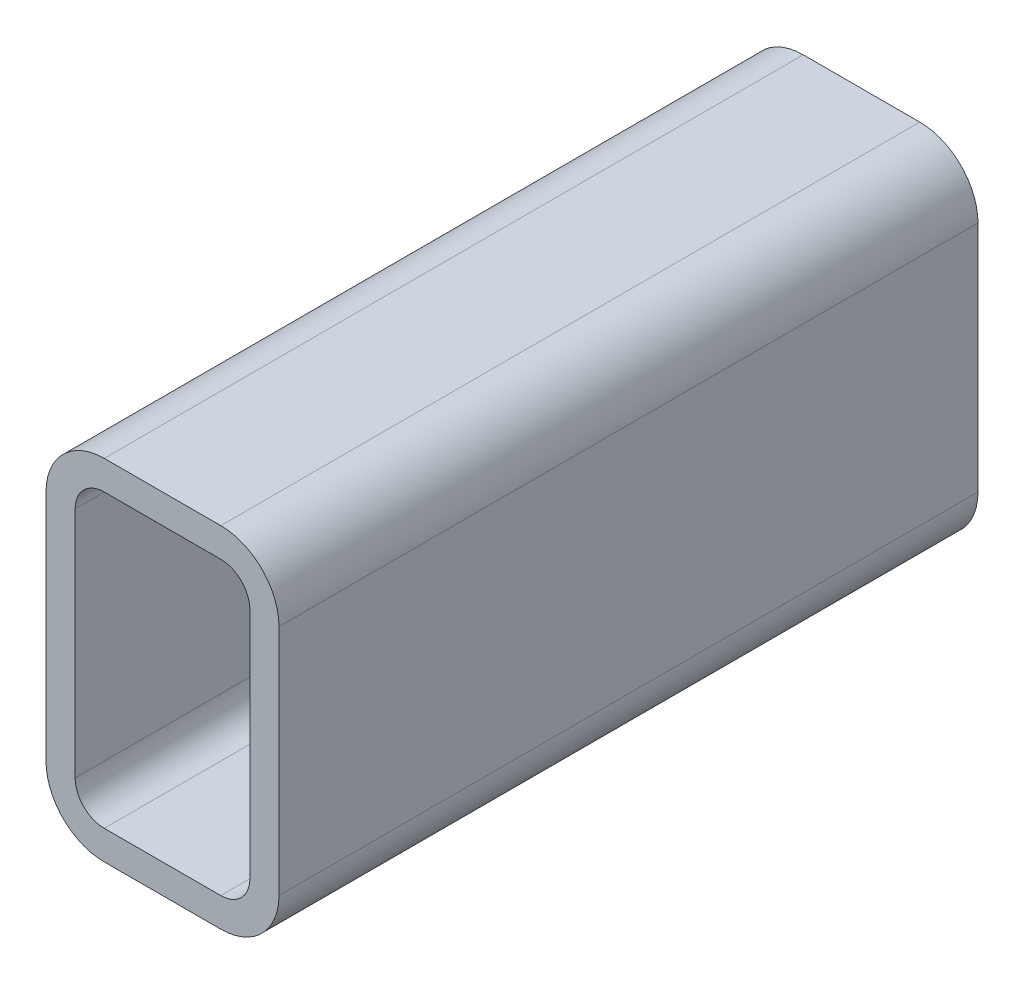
ISO-10303-21;
HEADER;
FILE_DESCRIPTION(('STEP AP214'),'2;1');
FILE_NAME('part.step','',(''),(''),'','','');
FILE_SCHEMA(('AUTOMOTIVE_DESIGN { 1 0 10303 214 1 1 1 1 }'));
ENDSEC;
DATA;
#1=APPLICATION_CONTEXT('core data for automotive mechanical design processes');
#2=APPLICATION_PROTOCOL_DEFINITION('international standard','automotive_design',2000,#1);
#3=PRODUCT_CONTEXT('',#1,'mechanical');
#4=PRODUCT('Part','Part','',(#3));
#5=PRODUCT_RELATED_PRODUCT_CATEGORY('part','',(#4));
#6=PRODUCT_DEFINITION_FORMATION('','',#4);
#7=PRODUCT_DEFINITION_CONTEXT('part definition',#1,'design');
#8=PRODUCT_DEFINITION('design','',#6,#7);
#9=PRODUCT_DEFINITION_SHAPE('','',#8);
#10=(LENGTH_UNIT() NAMED_UNIT(*) SI_UNIT(.MILLI.,.METRE.));
#11=(NAMED_UNIT(*) PLANE_ANGLE_UNIT() SI_UNIT($,.RADIAN.));
#12=(NAMED_UNIT(*) SI_UNIT($,.STERADIAN.) SOLID_ANGLE_UNIT());
#13=UNCERTAINTY_MEASURE_WITH_UNIT(LENGTH_MEASURE(1.E-05),#10,'distance_accuracy_value','');
#14=(GEOMETRIC_REPRESENTATION_CONTEXT(3) GLOBAL_UNCERTAINTY_ASSIGNED_CONTEXT((#13)) GLOBAL_UNIT_ASSIGNED_CONTEXT((#10,
#11,#12)) REPRESENTATION_CONTEXT('',''));
#15=CARTESIAN_POINT('',(0.,0.,0.));
#16=DIRECTION('',(0.,0.,1.));
#17=DIRECTION('',(1.,0.,0.));
#18=AXIS2_PLACEMENT_3D('',#15,#16,#17);
#19=CARTESIAN_POINT('',(27.0751778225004,129.011948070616,304.8));
#20=DIRECTION('',(0.,0.,1.));
#21=DIRECTION('',(1.,0.,0.));
#22=AXIS2_PLACEMENT_3D('',#19,#20,#21);
#23=PLANE('',#22);
#24=CARTESIAN_POINT('',(27.0751778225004,129.011948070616,304.8));
#25=DIRECTION('',(0.,0.,1.));
#26=DIRECTION('',(1.,0.,0.));
#27=AXIS2_PLACEMENT_3D('',#24,#25,#26);
#28=CIRCLE('',#27,25.4);
#29=CARTESIAN_POINT('',(27.0751778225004,154.411948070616,304.8));
#30=VERTEX_POINT('',#29);
#31=CARTESIAN_POINT('',(1.67517782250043,129.011948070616,304.8));
#32=VERTEX_POINT('',#31);
#33=EDGE_CURVE('E211',#30,#32,#28,.T.);
#34=ORIENTED_EDGE('',*,*,#33,.T.);
#35=DIRECTION('',(0.,-1.,0.));
#36=VECTOR('',#35,1.);
#37=CARTESIAN_POINT('',(1.67517782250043,27.4119480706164,304.8));
#38=LINE('',#37,#36);
#39=CARTESIAN_POINT('',(1.67517782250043,27.4119480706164,304.8));
#40=VERTEX_POINT('',#39);
#41=EDGE_CURVE('E214',#32,#40,#38,.T.);
#42=ORIENTED_EDGE('',*,*,#41,.T.);
#43=CARTESIAN_POINT('',(27.0751778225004,27.4119480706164,304.8));
#44=DIRECTION('',(0.,0.,1.));
#45=DIRECTION('',(1.,0.,0.));
#46=AXIS2_PLACEMENT_3D('',#43,#44,#45);
#47=CIRCLE('',#46,25.4);
#48=CARTESIAN_POINT('',(27.0751778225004,2.01194807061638,304.8));
#49=VERTEX_POINT('',#48);
#50=EDGE_CURVE('E217',#40,#49,#47,.T.);
#51=ORIENTED_EDGE('',*,*,#50,.T.);
#52=DIRECTION('',(1.,0.,0.));
#53=VECTOR('',#52,1.);
#54=CARTESIAN_POINT('',(77.8751778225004,2.01194807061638,304.8));
#55=LINE('',#54,#53);
#56=CARTESIAN_POINT('',(77.8751778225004,2.01194807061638,304.8));
#57=VERTEX_POINT('',#56);
#58=EDGE_CURVE('E219',#49,#57,#55,.T.);
#59=ORIENTED_EDGE('',*,*,#58,.T.);
#60=CARTESIAN_POINT('',(77.8751778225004,27.4119480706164,304.8));
#61=DIRECTION('',(0.,0.,1.));
#62=DIRECTION('',(1.,0.,0.));
#63=AXIS2_PLACEMENT_3D('',#60,#61,#62);
#64=CIRCLE('',#63,25.4);
#65=CARTESIAN_POINT('',(103.2751778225,27.4119480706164,304.8));
#66=VERTEX_POINT('',#65);
#67=EDGE_CURVE('E221',#57,#66,#64,.T.);
#68=ORIENTED_EDGE('',*,*,#67,.T.);
#69=DIRECTION('',(0.,1.,0.));
#70=VECTOR('',#69,1.);
#71=CARTESIAN_POINT('',(103.2751778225,129.011948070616,304.8));
#72=LINE('',#71,#70);
#73=CARTESIAN_POINT('',(103.2751778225,129.011948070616,304.8));
#74=VERTEX_POINT('',#73);
#75=EDGE_CURVE('E223',#66,#74,#72,.T.);
#76=ORIENTED_EDGE('',*,*,#75,.T.);
#77=CARTESIAN_POINT('',(77.8751778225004,129.011948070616,304.8));
#78=DIRECTION('',(0.,0.,1.));
#79=DIRECTION('',(1.,0.,0.));
#80=AXIS2_PLACEMENT_3D('',#77,#78,#79);
#81=CIRCLE('',#80,25.4);
#82=CARTESIAN_POINT('',(77.8751778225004,154.411948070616,304.8));
#83=VERTEX_POINT('',#82);
#84=EDGE_CURVE('E225',#74,#83,#81,.T.);
#85=ORIENTED_EDGE('',*,*,#84,.T.);
#86=DIRECTION('',(-1.,0.,0.));
#87=VECTOR('',#86,1.);
#88=CARTESIAN_POINT('',(27.0751778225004,154.411948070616,304.8));
#89=LINE('',#88,#87);
#90=EDGE_CURVE('E227',#83,#30,#89,.T.);
#91=ORIENTED_EDGE('',*,*,#90,.T.);
#92=EDGE_LOOP('',(#34,#42,#51,#59,#68,#76,#85,#91));
#93=FACE_BOUND('',#92,.T.);
#94=DIRECTION('',(0.,-1.,0.));
#95=VECTOR('',#94,1.);
#96=CARTESIAN_POINT('',(14.3751778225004,27.4119480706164,304.8));
#97=LINE('',#96,#95);
#98=CARTESIAN_POINT('',(14.3751778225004,129.011948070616,304.8));
#99=VERTEX_POINT('',#98);
#100=CARTESIAN_POINT('',(14.3751778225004,27.4119480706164,304.8));
#101=VERTEX_POINT('',#100);
#102=EDGE_CURVE('E154',#99,#101,#97,.T.);
#103=ORIENTED_EDGE('',*,*,#102,.F.);
#104=CARTESIAN_POINT('',(27.0751778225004,129.011948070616,304.8));
#105=DIRECTION('',(0.,0.,1.));
#106=DIRECTION('',(1.,0.,0.));
#107=AXIS2_PLACEMENT_3D('',#104,#105,#106);
#108=CIRCLE('',#107,12.7);
#109=CARTESIAN_POINT('',(27.0751778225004,141.711948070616,304.8));
#110=VERTEX_POINT('',#109);
#111=EDGE_CURVE('E146',#110,#99,#108,.T.);
#112=ORIENTED_EDGE('',*,*,#111,.F.);
#113=DIRECTION('',(-1.,0.,0.));
#114=VECTOR('',#113,1.);
#115=CARTESIAN_POINT('',(27.0751778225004,141.711948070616,304.8));
#116=LINE('',#115,#114);
#117=CARTESIAN_POINT('',(77.8751778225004,141.711948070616,304.8));
#118=VERTEX_POINT('',#117);
#119=EDGE_CURVE('E179',#118,#110,#116,.T.);
#120=ORIENTED_EDGE('',*,*,#119,.F.);
#121=CARTESIAN_POINT('',(77.8751778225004,129.011948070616,304.8));
#122=DIRECTION('',(0.,0.,1.));
#123=DIRECTION('',(1.,0.,0.));
#124=AXIS2_PLACEMENT_3D('',#121,#122,#123);
#125=CIRCLE('',#124,12.7);
#126=CARTESIAN_POINT('',(90.5751778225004,129.011948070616,304.8));
#127=VERTEX_POINT('',#126);
#128=EDGE_CURVE('E177',#127,#118,#125,.T.);
#129=ORIENTED_EDGE('',*,*,#128,.F.);
#130=DIRECTION('',(0.,1.,0.));
#131=VECTOR('',#130,1.);
#132=CARTESIAN_POINT('',(90.5751778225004,129.011948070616,304.8));
#133=LINE('',#132,#131);
#134=CARTESIAN_POINT('',(90.5751778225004,27.4119480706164,304.8));
#135=VERTEX_POINT('',#134);
#136=EDGE_CURVE('E175',#135,#127,#133,.T.);
#137=ORIENTED_EDGE('',*,*,#136,.F.);
#138=CARTESIAN_POINT('',(77.8751778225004,27.4119480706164,304.8));
#139=DIRECTION('',(0.,0.,1.));
#140=DIRECTION('',(1.,0.,0.));
#141=AXIS2_PLACEMENT_3D('',#138,#139,#140);
#142=CIRCLE('',#141,12.7);
#143=CARTESIAN_POINT('',(77.8751778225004,14.7119480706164,304.8));
#144=VERTEX_POINT('',#143);
#145=EDGE_CURVE('E173',#144,#135,#142,.T.);
#146=ORIENTED_EDGE('',*,*,#145,.F.);
#147=DIRECTION('',(1.,0.,0.));
#148=VECTOR('',#147,1.);
#149=CARTESIAN_POINT('',(77.8751778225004,14.7119480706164,304.8));
#150=LINE('',#149,#148);
#151=CARTESIAN_POINT('',(27.0751778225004,14.7119480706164,304.8));
#152=VERTEX_POINT('',#151);
#153=EDGE_CURVE('E169',#152,#144,#150,.T.);
#154=ORIENTED_EDGE('',*,*,#153,.F.);
#155=CARTESIAN_POINT('',(27.0751778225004,27.4119480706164,304.8));
#156=DIRECTION('',(0.,0.,1.));
#157=DIRECTION('',(1.,0.,0.));
#158=AXIS2_PLACEMENT_3D('',#155,#156,#157);
#159=CIRCLE('',#158,12.7);
#160=EDGE_CURVE('E167',#101,#152,#159,.T.);
#161=ORIENTED_EDGE('',*,*,#160,.F.);
#162=EDGE_LOOP('',(#103,#112,#120,#129,#137,#146,#154,#161));
#163=FACE_BOUND('',#162,.T.);
#164=ADVANCED_FACE('F33',(#93,#163),#23,.T.);
#165=CARTESIAN_POINT('',(27.0751778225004,129.011948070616,0.));
#166=DIRECTION('',(0.,0.,1.));
#167=DIRECTION('',(1.,0.,0.));
#168=AXIS2_PLACEMENT_3D('',#165,#166,#167);
#169=PLANE('',#168);
#170=CARTESIAN_POINT('',(27.0751778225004,129.011948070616,0.));
#171=DIRECTION('',(0.,0.,1.));
#172=DIRECTION('',(1.,0.,0.));
#173=AXIS2_PLACEMENT_3D('',#170,#171,#172);
#174=CIRCLE('',#173,25.4);
#175=CARTESIAN_POINT('',(27.0751778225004,154.411948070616,0.));
#176=VERTEX_POINT('',#175);
#177=CARTESIAN_POINT('',(1.67517782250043,129.011948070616,0.));
#178=VERTEX_POINT('',#177);
#179=EDGE_CURVE('E162',#176,#178,#174,.T.);
#180=ORIENTED_EDGE('',*,*,#179,.F.);
#181=DIRECTION('',(-1.,0.,0.));
#182=VECTOR('',#181,1.);
#183=CARTESIAN_POINT('',(27.0751778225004,154.411948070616,0.));
#184=LINE('',#183,#182);
#185=CARTESIAN_POINT('',(77.8751778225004,154.411948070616,0.));
#186=VERTEX_POINT('',#185);
#187=EDGE_CURVE('E215',#186,#176,#184,.T.);
#188=ORIENTED_EDGE('',*,*,#187,.F.);
#189=CARTESIAN_POINT('',(77.8751778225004,129.011948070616,0.));
#190=DIRECTION('',(0.,0.,1.));
#191=DIRECTION('',(1.,0.,0.));
#192=AXIS2_PLACEMENT_3D('',#189,#190,#191);
#193=CIRCLE('',#192,25.4);
#194=CARTESIAN_POINT('',(103.2751778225,129.011948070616,0.));
#195=VERTEX_POINT('',#194);
#196=EDGE_CURVE('E242',#195,#186,#193,.T.);
#197=ORIENTED_EDGE('',*,*,#196,.F.);
#198=DIRECTION('',(0.,1.,0.));
#199=VECTOR('',#198,1.);
#200=CARTESIAN_POINT('',(103.2751778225,129.011948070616,0.));
#201=LINE('',#200,#199);
#202=CARTESIAN_POINT('',(103.2751778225,27.4119480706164,0.));
#203=VERTEX_POINT('',#202);
#204=EDGE_CURVE('E240',#203,#195,#201,.T.);
#205=ORIENTED_EDGE('',*,*,#204,.F.);
#206=CARTESIAN_POINT('',(77.8751778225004,27.4119480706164,0.));
#207=DIRECTION('',(0.,0.,1.));
#208=DIRECTION('',(1.,0.,0.));
#209=AXIS2_PLACEMENT_3D('',#206,#207,#208);
#210=CIRCLE('',#209,25.4);
#211=CARTESIAN_POINT('',(77.8751778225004,2.01194807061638,0.));
#212=VERTEX_POINT('',#211);
#213=EDGE_CURVE('E238',#212,#203,#210,.T.);
#214=ORIENTED_EDGE('',*,*,#213,.F.);
#215=DIRECTION('',(1.,0.,0.));
#216=VECTOR('',#215,1.);
#217=CARTESIAN_POINT('',(77.8751778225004,2.01194807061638,0.));
#218=LINE('',#217,#216);
#219=CARTESIAN_POINT('',(27.0751778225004,2.01194807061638,0.));
#220=VERTEX_POINT('',#219);
#221=EDGE_CURVE('E236',#220,#212,#218,.T.);
#222=ORIENTED_EDGE('',*,*,#221,.F.);
#223=CARTESIAN_POINT('',(27.0751778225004,27.4119480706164,0.));
#224=DIRECTION('',(0.,0.,1.));
#225=DIRECTION('',(1.,0.,0.));
#226=AXIS2_PLACEMENT_3D('',#223,#224,#225);
#227=CIRCLE('',#226,25.4);
#228=CARTESIAN_POINT('',(1.67517782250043,27.4119480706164,0.));
#229=VERTEX_POINT('',#228);
#230=EDGE_CURVE('E234',#229,#220,#227,.T.);
#231=ORIENTED_EDGE('',*,*,#230,.F.);
#232=DIRECTION('',(0.,-1.,0.));
#233=VECTOR('',#232,1.);
#234=CARTESIAN_POINT('',(1.67517782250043,27.4119480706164,0.));
#235=LINE('',#234,#233);
#236=EDGE_CURVE('E232',#178,#229,#235,.T.);
#237=ORIENTED_EDGE('',*,*,#236,.F.);
#238=EDGE_LOOP('',(#180,#188,#197,#205,#214,#222,#231,#237));
#239=FACE_BOUND('',#238,.T.);
#240=CARTESIAN_POINT('',(27.0751778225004,129.011948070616,0.));
#241=DIRECTION('',(0.,0.,1.));
#242=DIRECTION('',(1.,0.,0.));
#243=AXIS2_PLACEMENT_3D('',#240,#241,#242);
#244=CIRCLE('',#243,12.7);
#245=CARTESIAN_POINT('',(27.0751778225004,141.711948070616,0.));
#246=VERTEX_POINT('',#245);
#247=CARTESIAN_POINT('',(14.3751778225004,129.011948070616,0.));
#248=VERTEX_POINT('',#247);
#249=EDGE_CURVE('E56',#246,#248,#244,.T.);
#250=ORIENTED_EDGE('',*,*,#249,.T.);
#251=DIRECTION('',(0.,-1.,0.));
#252=VECTOR('',#251,1.);
#253=CARTESIAN_POINT('',(14.3751778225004,27.4119480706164,0.));
#254=LINE('',#253,#252);
#255=CARTESIAN_POINT('',(14.3751778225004,27.4119480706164,0.));
#256=VERTEX_POINT('',#255);
#257=EDGE_CURVE('E161',#248,#256,#254,.T.);
#258=ORIENTED_EDGE('',*,*,#257,.T.);
#259=CARTESIAN_POINT('',(27.0751778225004,27.4119480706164,0.));
#260=DIRECTION('',(0.,0.,1.));
#261=DIRECTION('',(1.,0.,0.));
#262=AXIS2_PLACEMENT_3D('',#259,#260,#261);
#263=CIRCLE('',#262,12.7);
#264=CARTESIAN_POINT('',(27.0751778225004,14.7119480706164,0.));
#265=VERTEX_POINT('',#264);
#266=EDGE_CURVE('E183',#256,#265,#263,.T.);
#267=ORIENTED_EDGE('',*,*,#266,.T.);
#268=DIRECTION('',(1.,0.,0.));
#269=VECTOR('',#268,1.);
#270=CARTESIAN_POINT('',(77.8751778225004,14.7119480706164,0.));
#271=LINE('',#270,#269);
#272=CARTESIAN_POINT('',(77.8751778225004,14.7119480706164,0.));
#273=VERTEX_POINT('',#272);
#274=EDGE_CURVE('E186',#265,#273,#271,.T.);
#275=ORIENTED_EDGE('',*,*,#274,.T.);
#276=CARTESIAN_POINT('',(77.8751778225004,27.4119480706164,0.));
#277=DIRECTION('',(0.,0.,1.));
#278=DIRECTION('',(1.,0.,0.));
#279=AXIS2_PLACEMENT_3D('',#276,#277,#278);
#280=CIRCLE('',#279,12.7);
#281=CARTESIAN_POINT('',(90.5751778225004,27.4119480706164,0.));
#282=VERTEX_POINT('',#281);
#283=EDGE_CURVE('E189',#273,#282,#280,.T.);
#284=ORIENTED_EDGE('',*,*,#283,.T.);
#285=DIRECTION('',(0.,1.,0.));
#286=VECTOR('',#285,1.);
#287=CARTESIAN_POINT('',(90.5751778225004,129.011948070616,0.));
#288=LINE('',#287,#286);
#289=CARTESIAN_POINT('',(90.5751778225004,129.011948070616,0.));
#290=VERTEX_POINT('',#289);
#291=EDGE_CURVE('E192',#282,#290,#288,.T.);
#292=ORIENTED_EDGE('',*,*,#291,.T.);
#293=CARTESIAN_POINT('',(77.8751778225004,129.011948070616,0.));
#294=DIRECTION('',(0.,0.,1.));
#295=DIRECTION('',(1.,0.,0.));
#296=AXIS2_PLACEMENT_3D('',#293,#294,#295);
#297=CIRCLE('',#296,12.7);
#298=CARTESIAN_POINT('',(77.8751778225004,141.711948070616,0.));
#299=VERTEX_POINT('',#298);
#300=EDGE_CURVE('E195',#290,#299,#297,.T.);
#301=ORIENTED_EDGE('',*,*,#300,.T.);
#302=DIRECTION('',(-1.,0.,0.));
#303=VECTOR('',#302,1.);
#304=CARTESIAN_POINT('',(27.0751778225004,141.711948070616,0.));
#305=LINE('',#304,#303);
#306=EDGE_CURVE('E155',#299,#246,#305,.T.);
#307=ORIENTED_EDGE('',*,*,#306,.T.);
#308=EDGE_LOOP('',(#250,#258,#267,#275,#284,#292,#301,#307));
#309=FACE_BOUND('',#308,.T.);
#310=ADVANCED_FACE('F272',(#239,#309),#169,.F.);
#311=CARTESIAN_POINT('',(27.0751778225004,129.011948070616,304.8));
#312=DIRECTION('',(0.,0.,-1.));
#313=DIRECTION('',(-1.,0.,0.));
#314=AXIS2_PLACEMENT_3D('',#311,#312,#313);
#315=CYLINDRICAL_SURFACE('',#314,25.4);
#316=ORIENTED_EDGE('',*,*,#179,.T.);
#317=DIRECTION('',(0.,0.,-1.));
#318=VECTOR('',#317,1.);
#319=CARTESIAN_POINT('',(1.67517782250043,129.011948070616,304.8));
#320=LINE('',#319,#318);
#321=EDGE_CURVE('E11',#32,#178,#320,.T.);
#322=ORIENTED_EDGE('',*,*,#321,.F.);
#323=ORIENTED_EDGE('',*,*,#33,.F.);
#324=DIRECTION('',(0.,0.,-1.));
#325=VECTOR('',#324,1.);
#326=CARTESIAN_POINT('',(27.0751778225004,154.411948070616,304.8));
#327=LINE('',#326,#325);
#328=EDGE_CURVE('E229',#30,#176,#327,.T.);
#329=ORIENTED_EDGE('',*,*,#328,.T.);
#330=EDGE_LOOP('',(#316,#322,#323,#329));
#331=FACE_BOUND('',#330,.T.);
#332=ADVANCED_FACE('F35',(#331),#315,.T.);
#333=CARTESIAN_POINT('',(1.67517782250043,27.4119480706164,304.8));
#334=DIRECTION('',(1.,0.,0.));
#335=DIRECTION('',(0.,0.,-1.));
#336=AXIS2_PLACEMENT_3D('',#333,#334,#335);
#337=PLANE('',#336);
#338=ORIENTED_EDGE('',*,*,#236,.T.);
#339=DIRECTION('',(0.,0.,-1.));
#340=VECTOR('',#339,1.);
#341=CARTESIAN_POINT('',(1.67517782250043,27.4119480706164,304.8));
#342=LINE('',#341,#340);
#343=EDGE_CURVE('E41',#40,#229,#342,.T.);
#344=ORIENTED_EDGE('',*,*,#343,.F.);
#345=ORIENTED_EDGE('',*,*,#41,.F.);
#346=ORIENTED_EDGE('',*,*,#321,.T.);
#347=EDGE_LOOP('',(#338,#344,#345,#346));
#348=FACE_BOUND('',#347,.T.);
#349=ADVANCED_FACE('F289',(#348),#337,.F.);
#350=CARTESIAN_POINT('',(27.0751778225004,27.4119480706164,304.8));
#351=DIRECTION('',(0.,0.,-1.));
#352=DIRECTION('',(-1.,0.,0.));
#353=AXIS2_PLACEMENT_3D('',#350,#351,#352);
#354=CYLINDRICAL_SURFACE('',#353,25.4);
#355=ORIENTED_EDGE('',*,*,#230,.T.);
#356=DIRECTION('',(0.,0.,-1.));
#357=VECTOR('',#356,1.);
#358=CARTESIAN_POINT('',(27.0751778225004,2.01194807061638,304.8));
#359=LINE('',#358,#357);
#360=EDGE_CURVE('E259',#49,#220,#359,.T.);
#361=ORIENTED_EDGE('',*,*,#360,.F.);
#362=ORIENTED_EDGE('',*,*,#50,.F.);
#363=ORIENTED_EDGE('',*,*,#343,.T.);
#364=EDGE_LOOP('',(#355,#361,#362,#363));
#365=FACE_BOUND('',#364,.T.);
#366=ADVANCED_FACE('F266',(#365),#354,.T.);
#367=CARTESIAN_POINT('',(77.8751778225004,2.01194807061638,304.8));
#368=DIRECTION('',(0.,1.,0.));
#369=DIRECTION('',(0.,0.,1.));
#370=AXIS2_PLACEMENT_3D('',#367,#368,#369);
#371=PLANE('',#370);
#372=ORIENTED_EDGE('',*,*,#221,.T.);
#373=DIRECTION('',(0.,0.,-1.));
#374=VECTOR('',#373,1.);
#375=CARTESIAN_POINT('',(77.8751778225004,2.01194807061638,304.8));
#376=LINE('',#375,#374);
#377=EDGE_CURVE('E256',#57,#212,#376,.T.);
#378=ORIENTED_EDGE('',*,*,#377,.F.);
#379=ORIENTED_EDGE('',*,*,#58,.F.);
#380=ORIENTED_EDGE('',*,*,#360,.T.);
#381=EDGE_LOOP('',(#372,#378,#379,#380));
#382=FACE_BOUND('',#381,.T.);
#383=ADVANCED_FACE('F278',(#382),#371,.F.);
#384=CARTESIAN_POINT('',(77.8751778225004,27.4119480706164,304.8));
#385=DIRECTION('',(0.,0.,-1.));
#386=DIRECTION('',(-1.,0.,0.));
#387=AXIS2_PLACEMENT_3D('',#384,#385,#386);
#388=CYLINDRICAL_SURFACE('',#387,25.4);
#389=ORIENTED_EDGE('',*,*,#213,.T.);
#390=DIRECTION('',(0.,0.,-1.));
#391=VECTOR('',#390,1.);
#392=CARTESIAN_POINT('',(103.2751778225,27.4119480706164,304.8));
#393=LINE('',#392,#391);
#394=EDGE_CURVE('E253',#66,#203,#393,.T.);
#395=ORIENTED_EDGE('',*,*,#394,.F.);
#396=ORIENTED_EDGE('',*,*,#67,.F.);
#397=ORIENTED_EDGE('',*,*,#377,.T.);
#398=EDGE_LOOP('',(#389,#395,#396,#397));
#399=FACE_BOUND('',#398,.T.);
#400=ADVANCED_FACE('F282',(#399),#388,.T.);
#401=CARTESIAN_POINT('',(103.2751778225,129.011948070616,304.8));
#402=DIRECTION('',(-1.,0.,0.));
#403=DIRECTION('',(0.,0.,1.));
#404=AXIS2_PLACEMENT_3D('',#401,#402,#403);
#405=PLANE('',#404);
#406=ORIENTED_EDGE('',*,*,#204,.T.);
#407=DIRECTION('',(0.,0.,-1.));
#408=VECTOR('',#407,1.);
#409=CARTESIAN_POINT('',(103.2751778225,129.011948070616,304.8));
#410=LINE('',#409,#408);
#411=EDGE_CURVE('E250',#74,#195,#410,.T.);
#412=ORIENTED_EDGE('',*,*,#411,.F.);
#413=ORIENTED_EDGE('',*,*,#75,.F.);
#414=ORIENTED_EDGE('',*,*,#394,.T.);
#415=EDGE_LOOP('',(#406,#412,#413,#414));
#416=FACE_BOUND('',#415,.T.);
#417=ADVANCED_FACE('F302',(#416),#405,.F.);
#418=CARTESIAN_POINT('',(77.8751778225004,129.011948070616,304.8));
#419=DIRECTION('',(0.,0.,-1.));
#420=DIRECTION('',(-1.,0.,0.));
#421=AXIS2_PLACEMENT_3D('',#418,#419,#420);
#422=CYLINDRICAL_SURFACE('',#421,25.4);
#423=ORIENTED_EDGE('',*,*,#196,.T.);
#424=DIRECTION('',(0.,0.,-1.));
#425=VECTOR('',#424,1.);
#426=CARTESIAN_POINT('',(77.8751778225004,154.411948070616,304.8));
#427=LINE('',#426,#425);
#428=EDGE_CURVE('E247',#83,#186,#427,.T.);
#429=ORIENTED_EDGE('',*,*,#428,.F.);
#430=ORIENTED_EDGE('',*,*,#84,.F.);
#431=ORIENTED_EDGE('',*,*,#411,.T.);
#432=EDGE_LOOP('',(#423,#429,#430,#431));
#433=FACE_BOUND('',#432,.T.);
#434=ADVANCED_FACE('F300',(#433),#422,.T.);
#435=CARTESIAN_POINT('',(27.0751778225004,154.411948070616,304.8));
#436=DIRECTION('',(0.,-1.,0.));
#437=DIRECTION('',(0.,0.,-1.));
#438=AXIS2_PLACEMENT_3D('',#435,#436,#437);
#439=PLANE('',#438);
#440=ORIENTED_EDGE('',*,*,#187,.T.);
#441=ORIENTED_EDGE('',*,*,#328,.F.);
#442=ORIENTED_EDGE('',*,*,#90,.F.);
#443=ORIENTED_EDGE('',*,*,#428,.T.);
#444=EDGE_LOOP('',(#440,#441,#442,#443));
#445=FACE_BOUND('',#444,.T.);
#446=ADVANCED_FACE('F295',(#445),#439,.F.);
#447=CARTESIAN_POINT('',(27.0751778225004,129.011948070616,304.8));
#448=DIRECTION('',(0.,0.,-1.));
#449=DIRECTION('',(-1.,0.,0.));
#450=AXIS2_PLACEMENT_3D('',#447,#448,#449);
#451=CYLINDRICAL_SURFACE('',#450,12.7);
#452=ORIENTED_EDGE('',*,*,#249,.F.);
#453=DIRECTION('',(0.,0.,-1.));
#454=VECTOR('',#453,1.);
#455=CARTESIAN_POINT('',(27.0751778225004,141.711948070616,304.8));
#456=LINE('',#455,#454);
#457=EDGE_CURVE('E150',#110,#246,#456,.T.);
#458=ORIENTED_EDGE('',*,*,#457,.F.);
#459=ORIENTED_EDGE('',*,*,#111,.T.);
#460=DIRECTION('',(0.,0.,-1.));
#461=VECTOR('',#460,1.);
#462=CARTESIAN_POINT('',(14.3751778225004,129.011948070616,304.8));
#463=LINE('',#462,#461);
#464=EDGE_CURVE('E149',#99,#248,#463,.T.);
#465=ORIENTED_EDGE('',*,*,#464,.T.);
#466=EDGE_LOOP('',(#452,#458,#459,#465));
#467=FACE_BOUND('',#466,.T.);
#468=ADVANCED_FACE('F148',(#467),#451,.F.);
#469=CARTESIAN_POINT('',(14.3751778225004,27.4119480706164,304.8));
#470=DIRECTION('',(1.,0.,0.));
#471=DIRECTION('',(0.,0.,-1.));
#472=AXIS2_PLACEMENT_3D('',#469,#470,#471);
#473=PLANE('',#472);
#474=ORIENTED_EDGE('',*,*,#257,.F.);
#475=ORIENTED_EDGE('',*,*,#464,.F.);
#476=ORIENTED_EDGE('',*,*,#102,.T.);
#477=DIRECTION('',(0.,0.,-1.));
#478=VECTOR('',#477,1.);
#479=CARTESIAN_POINT('',(14.3751778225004,27.4119480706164,304.8));
#480=LINE('',#479,#478);
#481=EDGE_CURVE('E163',#101,#256,#480,.T.);
#482=ORIENTED_EDGE('',*,*,#481,.T.);
#483=EDGE_LOOP('',(#474,#475,#476,#482));
#484=FACE_BOUND('',#483,.T.);
#485=ADVANCED_FACE('F158',(#484),#473,.T.);
#486=CARTESIAN_POINT('',(27.0751778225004,27.4119480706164,304.8));
#487=DIRECTION('',(0.,0.,-1.));
#488=DIRECTION('',(-1.,0.,0.));
#489=AXIS2_PLACEMENT_3D('',#486,#487,#488);
#490=CYLINDRICAL_SURFACE('',#489,12.7);
#491=ORIENTED_EDGE('',*,*,#266,.F.);
#492=ORIENTED_EDGE('',*,*,#481,.F.);
#493=ORIENTED_EDGE('',*,*,#160,.T.);
#494=DIRECTION('',(0.,0.,-1.));
#495=VECTOR('',#494,1.);
#496=CARTESIAN_POINT('',(27.0751778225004,14.7119480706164,304.8));
#497=LINE('',#496,#495);
#498=EDGE_CURVE('E208',#152,#265,#497,.T.);
#499=ORIENTED_EDGE('',*,*,#498,.T.);
#500=EDGE_LOOP('',(#491,#492,#493,#499));
#501=FACE_BOUND('',#500,.T.);
#502=ADVANCED_FACE('F327',(#501),#490,.F.);
#503=CARTESIAN_POINT('',(77.8751778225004,14.7119480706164,304.8));
#504=DIRECTION('',(0.,1.,0.));
#505=DIRECTION('',(0.,0.,1.));
#506=AXIS2_PLACEMENT_3D('',#503,#504,#505);
#507=PLANE('',#506);
#508=ORIENTED_EDGE('',*,*,#274,.F.);
#509=ORIENTED_EDGE('',*,*,#498,.F.);
#510=ORIENTED_EDGE('',*,*,#153,.T.);
#511=DIRECTION('',(0.,0.,-1.));
#512=VECTOR('',#511,1.);
#513=CARTESIAN_POINT('',(77.8751778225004,14.7119480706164,304.8));
#514=LINE('',#513,#512);
#515=EDGE_CURVE('E206',#144,#273,#514,.T.);
#516=ORIENTED_EDGE('',*,*,#515,.T.);
#517=EDGE_LOOP('',(#508,#509,#510,#516));
#518=FACE_BOUND('',#517,.T.);
#519=ADVANCED_FACE('F331',(#518),#507,.T.);
#520=CARTESIAN_POINT('',(77.8751778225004,27.4119480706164,304.8));
#521=DIRECTION('',(0.,0.,-1.));
#522=DIRECTION('',(-1.,0.,0.));
#523=AXIS2_PLACEMENT_3D('',#520,#521,#522);
#524=CYLINDRICAL_SURFACE('',#523,12.7);
#525=ORIENTED_EDGE('',*,*,#283,.F.);
#526=ORIENTED_EDGE('',*,*,#515,.F.);
#527=ORIENTED_EDGE('',*,*,#145,.T.);
#528=DIRECTION('',(0.,0.,-1.));
#529=VECTOR('',#528,1.);
#530=CARTESIAN_POINT('',(90.5751778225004,27.4119480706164,304.8));
#531=LINE('',#530,#529);
#532=EDGE_CURVE('E204',#135,#282,#531,.T.);
#533=ORIENTED_EDGE('',*,*,#532,.T.);
#534=EDGE_LOOP('',(#525,#526,#527,#533));
#535=FACE_BOUND('',#534,.T.);
#536=ADVANCED_FACE('F337',(#535),#524,.F.);
#537=CARTESIAN_POINT('',(90.5751778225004,129.011948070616,304.8));
#538=DIRECTION('',(-1.,0.,0.));
#539=DIRECTION('',(0.,0.,1.));
#540=AXIS2_PLACEMENT_3D('',#537,#538,#539);
#541=PLANE('',#540);
#542=ORIENTED_EDGE('',*,*,#291,.F.);
#543=ORIENTED_EDGE('',*,*,#532,.F.);
#544=ORIENTED_EDGE('',*,*,#136,.T.);
#545=DIRECTION('',(0.,0.,-1.));
#546=VECTOR('',#545,1.);
#547=CARTESIAN_POINT('',(90.5751778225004,129.011948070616,304.8));
#548=LINE('',#547,#546);
#549=EDGE_CURVE('E202',#127,#290,#548,.T.);
#550=ORIENTED_EDGE('',*,*,#549,.T.);
#551=EDGE_LOOP('',(#542,#543,#544,#550));
#552=FACE_BOUND('',#551,.T.);
#553=ADVANCED_FACE('F341',(#552),#541,.T.);
#554=CARTESIAN_POINT('',(77.8751778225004,129.011948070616,304.8));
#555=DIRECTION('',(0.,0.,-1.));
#556=DIRECTION('',(-1.,0.,0.));
#557=AXIS2_PLACEMENT_3D('',#554,#555,#556);
#558=CYLINDRICAL_SURFACE('',#557,12.7);
#559=ORIENTED_EDGE('',*,*,#300,.F.);
#560=ORIENTED_EDGE('',*,*,#549,.F.);
#561=ORIENTED_EDGE('',*,*,#128,.T.);
#562=DIRECTION('',(0.,0.,-1.));
#563=VECTOR('',#562,1.);
#564=CARTESIAN_POINT('',(77.8751778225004,141.711948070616,304.8));
#565=LINE('',#564,#563);
#566=EDGE_CURVE('E48',#118,#299,#565,.T.);
#567=ORIENTED_EDGE('',*,*,#566,.T.);
#568=EDGE_LOOP('',(#559,#560,#561,#567));
#569=FACE_BOUND('',#568,.T.);
#570=ADVANCED_FACE('F345',(#569),#558,.F.);
#571=CARTESIAN_POINT('',(27.0751778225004,141.711948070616,304.8));
#572=DIRECTION('',(0.,-1.,0.));
#573=DIRECTION('',(0.,0.,-1.));
#574=AXIS2_PLACEMENT_3D('',#571,#572,#573);
#575=PLANE('',#574);
#576=ORIENTED_EDGE('',*,*,#306,.F.);
#577=ORIENTED_EDGE('',*,*,#566,.F.);
#578=ORIENTED_EDGE('',*,*,#119,.T.);
#579=ORIENTED_EDGE('',*,*,#457,.T.);
#580=EDGE_LOOP('',(#576,#577,#578,#579));
#581=FACE_BOUND('',#580,.T.);
#582=ADVANCED_FACE('F349',(#581),#575,.T.);
#583=CLOSED_SHELL('',(#164,#310,#332,#349,#366,#383,#400,#417,#434,#446,#468,#485,#502,#519,
#536,#553,#570,#582));
#584=MANIFOLD_SOLID_BREP('B2',#583);
#585=ADVANCED_BREP_SHAPE_REPRESENTATION('',(#18,#584),#14);
#586=SHAPE_DEFINITION_REPRESENTATION(#9,#585);
ENDSEC;
END-ISO-10303-21;
